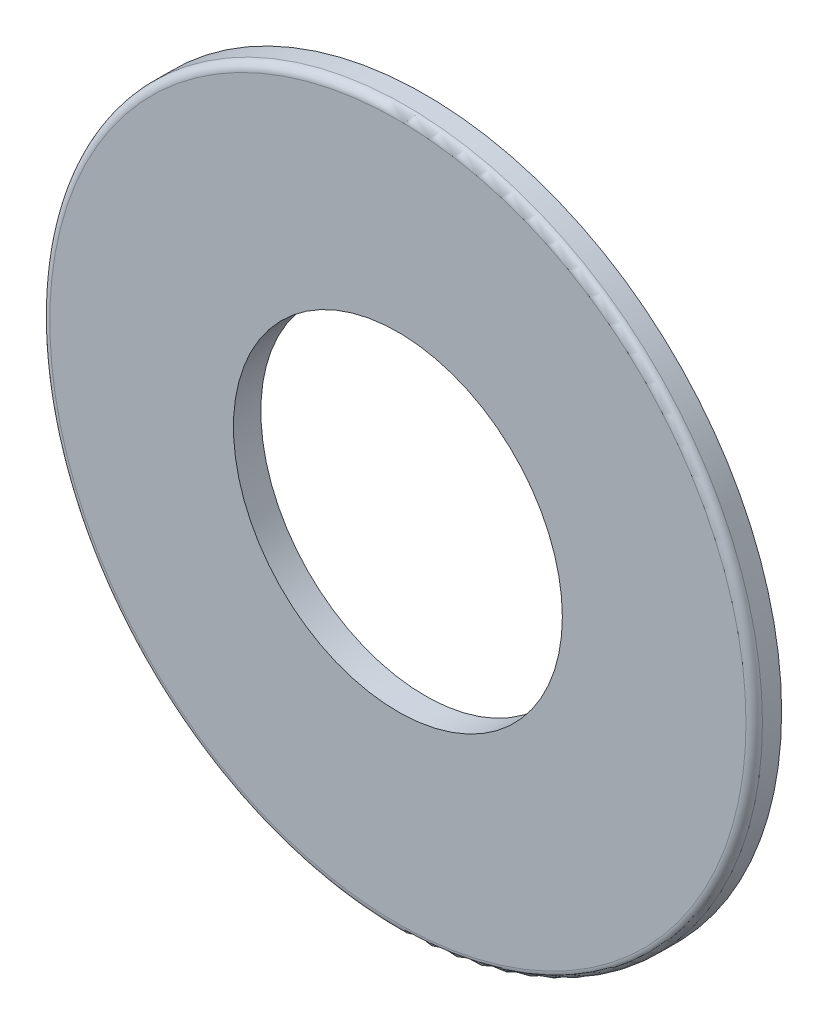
ISO-10303-21;
HEADER;
FILE_DESCRIPTION(('STEP AP214'),'2;1');
FILE_NAME('part.step','',(''),(''),'','','');
FILE_SCHEMA(('AUTOMOTIVE_DESIGN { 1 0 10303 214 1 1 1 1 }'));
ENDSEC;
DATA;
#1=APPLICATION_CONTEXT('core data for automotive mechanical design processes');
#2=APPLICATION_PROTOCOL_DEFINITION('international standard','automotive_design',2000,#1);
#3=PRODUCT_CONTEXT('',#1,'mechanical');
#4=PRODUCT('Part','Part','',(#3));
#5=PRODUCT_RELATED_PRODUCT_CATEGORY('part','',(#4));
#6=PRODUCT_DEFINITION_FORMATION('','',#4);
#7=PRODUCT_DEFINITION_CONTEXT('part definition',#1,'design');
#8=PRODUCT_DEFINITION('design','',#6,#7);
#9=PRODUCT_DEFINITION_SHAPE('','',#8);
#10=(LENGTH_UNIT() NAMED_UNIT(*) SI_UNIT(.MILLI.,.METRE.));
#11=(NAMED_UNIT(*) PLANE_ANGLE_UNIT() SI_UNIT($,.RADIAN.));
#12=(NAMED_UNIT(*) SI_UNIT($,.STERADIAN.) SOLID_ANGLE_UNIT());
#13=UNCERTAINTY_MEASURE_WITH_UNIT(LENGTH_MEASURE(1.E-05),#10,'distance_accuracy_value','');
#14=(GEOMETRIC_REPRESENTATION_CONTEXT(3) GLOBAL_UNCERTAINTY_ASSIGNED_CONTEXT((#13)) GLOBAL_UNIT_ASSIGNED_CONTEXT((#10,
#11,#12)) REPRESENTATION_CONTEXT('',''));
#15=CARTESIAN_POINT('',(0.,0.,0.));
#16=DIRECTION('',(0.,0.,1.));
#17=DIRECTION('',(1.,0.,0.));
#18=AXIS2_PLACEMENT_3D('',#15,#16,#17);
#19=CARTESIAN_POINT('',(82.8787948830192,208.830726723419,1.));
#20=DIRECTION('',(0.,0.,1.));
#21=DIRECTION('',(1.,0.,0.));
#22=AXIS2_PLACEMENT_3D('',#19,#20,#21);
#23=PLANE('',#22);
#24=CARTESIAN_POINT('',(82.8787948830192,208.830726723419,1.));
#25=DIRECTION('',(0.,0.,1.));
#26=DIRECTION('',(1.,0.,0.));
#27=AXIS2_PLACEMENT_3D('',#24,#25,#26);
#28=CIRCLE('',#27,12.7);
#29=CARTESIAN_POINT('',(95.5787948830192,208.830726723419,1.));
#30=VERTEX_POINT('',#29);
#31=EDGE_CURVE('E43',#30,#30,#28,.T.);
#32=ORIENTED_EDGE('',*,*,#31,.T.);
#33=EDGE_LOOP('',(#32));
#34=FACE_BOUND('',#33,.T.);
#35=CARTESIAN_POINT('',(82.8787948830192,208.830726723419,1.));
#36=DIRECTION('',(0.,0.,1.));
#37=DIRECTION('',(1.,0.,0.));
#38=AXIS2_PLACEMENT_3D('',#35,#36,#37);
#39=CIRCLE('',#38,6.);
#40=CARTESIAN_POINT('',(88.8787948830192,208.830726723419,1.));
#41=VERTEX_POINT('',#40);
#42=EDGE_CURVE('E51',#41,#41,#39,.T.);
#43=ORIENTED_EDGE('',*,*,#42,.F.);
#44=EDGE_LOOP('',(#43));
#45=FACE_BOUND('',#44,.T.);
#46=ADVANCED_FACE('F36',(#34,#45),#23,.T.);
#47=CARTESIAN_POINT('',(82.8787948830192,208.830726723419,0.));
#48=DIRECTION('',(0.,0.,1.));
#49=DIRECTION('',(1.,0.,0.));
#50=AXIS2_PLACEMENT_3D('',#47,#48,#49);
#51=PLANE('',#50);
#52=CARTESIAN_POINT('',(82.8787948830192,208.830726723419,0.));
#53=DIRECTION('',(0.,0.,1.));
#54=DIRECTION('',(1.,0.,0.));
#55=AXIS2_PLACEMENT_3D('',#52,#53,#54);
#56=CIRCLE('',#55,13.);
#57=CARTESIAN_POINT('',(95.8787948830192,208.830726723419,0.));
#58=VERTEX_POINT('',#57);
#59=EDGE_CURVE('E47',#58,#58,#56,.T.);
#60=ORIENTED_EDGE('',*,*,#59,.F.);
#61=EDGE_LOOP('',(#60));
#62=FACE_BOUND('',#61,.T.);
#63=CARTESIAN_POINT('',(82.8787948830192,208.830726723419,0.));
#64=DIRECTION('',(0.,0.,1.));
#65=DIRECTION('',(1.,0.,0.));
#66=AXIS2_PLACEMENT_3D('',#63,#64,#65);
#67=CIRCLE('',#66,6.);
#68=CARTESIAN_POINT('',(88.8787948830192,208.830726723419,0.));
#69=VERTEX_POINT('',#68);
#70=EDGE_CURVE('E54',#69,#69,#67,.T.);
#71=ORIENTED_EDGE('',*,*,#70,.T.);
#72=EDGE_LOOP('',(#71));
#73=FACE_BOUND('',#72,.T.);
#74=ADVANCED_FACE('F64',(#62,#73),#51,.F.);
#75=CARTESIAN_POINT('',(82.8787948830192,208.830726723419,1.));
#76=DIRECTION('',(0.,0.,-1.));
#77=DIRECTION('',(-1.,0.,0.));
#78=AXIS2_PLACEMENT_3D('',#75,#76,#77);
#79=CYLINDRICAL_SURFACE('',#78,13.);
#80=CARTESIAN_POINT('',(82.8787948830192,208.830726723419,0.7));
#81=DIRECTION('',(0.,0.,1.));
#82=DIRECTION('',(1.,0.,0.));
#83=AXIS2_PLACEMENT_3D('',#80,#81,#82);
#84=CIRCLE('',#83,13.);
#85=CARTESIAN_POINT('',(95.8787948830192,208.830726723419,0.7));
#86=VERTEX_POINT('',#85);
#87=EDGE_CURVE('E10',#86,#86,#84,.F.);
#88=ORIENTED_EDGE('',*,*,#87,.T.);
#89=EDGE_LOOP('',(#88));
#90=FACE_BOUND('',#89,.T.);
#91=ORIENTED_EDGE('',*,*,#59,.T.);
#92=EDGE_LOOP('',(#91));
#93=FACE_BOUND('',#92,.T.);
#94=ADVANCED_FACE('F69',(#90,#93),#79,.T.);
#95=CARTESIAN_POINT('',(82.8787948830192,208.830726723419,1.));
#96=DIRECTION('',(0.,0.,-1.));
#97=DIRECTION('',(-1.,0.,0.));
#98=AXIS2_PLACEMENT_3D('',#95,#96,#97);
#99=CYLINDRICAL_SURFACE('',#98,6.);
#100=ORIENTED_EDGE('',*,*,#42,.T.);
#101=EDGE_LOOP('',(#100));
#102=FACE_BOUND('',#101,.T.);
#103=ORIENTED_EDGE('',*,*,#70,.F.);
#104=EDGE_LOOP('',(#103));
#105=FACE_BOUND('',#104,.T.);
#106=ADVANCED_FACE('F60',(#102,#105),#99,.F.);
#107=CARTESIAN_POINT('',(82.8787948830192,208.830726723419,0.7));
#108=DIRECTION('',(0.,0.,1.));
#109=DIRECTION('',(1.,0.,0.));
#110=AXIS2_PLACEMENT_3D('',#107,#108,#109);
#111=TOROIDAL_SURFACE('',#110,12.7,0.3);
#112=ORIENTED_EDGE('',*,*,#87,.F.);
#113=EDGE_LOOP('',(#112));
#114=FACE_BOUND('',#113,.T.);
#115=ORIENTED_EDGE('',*,*,#31,.F.);
#116=EDGE_LOOP('',(#115));
#117=FACE_BOUND('',#116,.T.);
#118=ADVANCED_FACE('F38',(#114,#117),#111,.T.);
#119=CLOSED_SHELL('',(#46,#74,#94,#106,#118));
#120=MANIFOLD_SOLID_BREP('B2',#119);
#121=ADVANCED_BREP_SHAPE_REPRESENTATION('',(#18,#120),#14);
#122=SHAPE_DEFINITION_REPRESENTATION(#9,#121);
ENDSEC;
END-ISO-10303-21;
